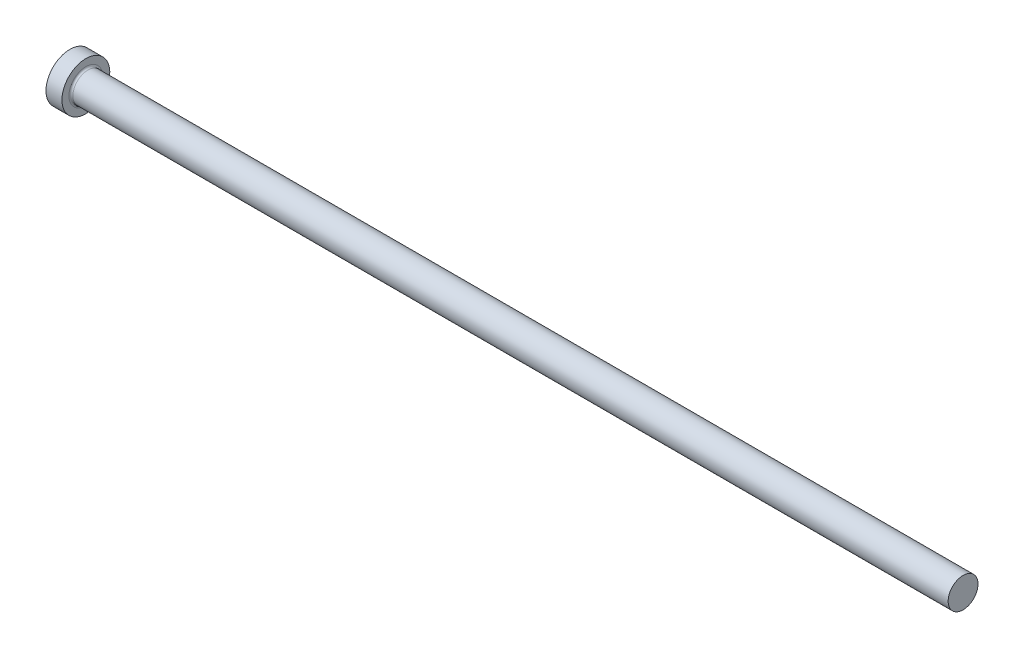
ISO-10303-21;
HEADER;
FILE_DESCRIPTION(('STEP AP214'),'2;1');
FILE_NAME('part.step','',(''),(''),'','','');
FILE_SCHEMA(('AUTOMOTIVE_DESIGN { 1 0 10303 214 1 1 1 1 }'));
ENDSEC;
DATA;
#1=APPLICATION_CONTEXT('core data for automotive mechanical design processes');
#2=APPLICATION_PROTOCOL_DEFINITION('international standard','automotive_design',2000,#1);
#3=PRODUCT_CONTEXT('',#1,'mechanical');
#4=PRODUCT('Part','Part','',(#3));
#5=PRODUCT_RELATED_PRODUCT_CATEGORY('part','',(#4));
#6=PRODUCT_DEFINITION_FORMATION('','',#4);
#7=PRODUCT_DEFINITION_CONTEXT('part definition',#1,'design');
#8=PRODUCT_DEFINITION('design','',#6,#7);
#9=PRODUCT_DEFINITION_SHAPE('','',#8);
#10=(LENGTH_UNIT() NAMED_UNIT(*) SI_UNIT(.MILLI.,.METRE.));
#11=(NAMED_UNIT(*) PLANE_ANGLE_UNIT() SI_UNIT($,.RADIAN.));
#12=(NAMED_UNIT(*) SI_UNIT($,.STERADIAN.) SOLID_ANGLE_UNIT());
#13=UNCERTAINTY_MEASURE_WITH_UNIT(LENGTH_MEASURE(1.E-05),#10,'distance_accuracy_value','');
#14=(GEOMETRIC_REPRESENTATION_CONTEXT(3) GLOBAL_UNCERTAINTY_ASSIGNED_CONTEXT((#13)) GLOBAL_UNIT_ASSIGNED_CONTEXT((#10,
#11,#12)) REPRESENTATION_CONTEXT('',''));
#15=CARTESIAN_POINT('',(0.,0.,0.));
#16=DIRECTION('',(0.,0.,1.));
#17=DIRECTION('',(1.,0.,0.));
#18=AXIS2_PLACEMENT_3D('',#15,#16,#17);
#19=CARTESIAN_POINT('',(0.,0.,0.));
#20=DIRECTION('',(1.,0.,0.));
#21=DIRECTION('',(0.,1.,0.));
#22=AXIS2_PLACEMENT_3D('',#19,#20,#21);
#23=PLANE('',#22);
#24=CARTESIAN_POINT('',(0.,0.,0.));
#25=DIRECTION('',(-1.,0.,0.));
#26=DIRECTION('',(0.,-1.,0.));
#27=AXIS2_PLACEMENT_3D('',#24,#25,#26);
#28=CIRCLE('',#27,9.52499999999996);
#29=CARTESIAN_POINT('',(0.,-9.52499999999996,0.));
#30=VERTEX_POINT('',#29);
#31=EDGE_CURVE('E10',#30,#30,#28,.T.);
#32=ORIENTED_EDGE('',*,*,#31,.T.);
#33=EDGE_LOOP('',(#32));
#34=FACE_BOUND('',#33,.T.);
#35=ADVANCED_FACE('F29',(#34),#23,.F.);
#36=CARTESIAN_POINT('',(355.6,0.,0.));
#37=DIRECTION('',(-1.,0.,0.));
#38=DIRECTION('',(0.,-1.,0.));
#39=AXIS2_PLACEMENT_3D('',#36,#37,#38);
#40=CYLINDRICAL_SURFACE('',#39,9.52499999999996);
#41=ORIENTED_EDGE('',*,*,#31,.F.);
#42=EDGE_LOOP('',(#41));
#43=FACE_BOUND('',#42,.T.);
#44=CARTESIAN_POINT('',(6.35000000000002,0.,0.));
#45=DIRECTION('',(-1.,0.,0.));
#46=DIRECTION('',(0.,-1.,0.));
#47=AXIS2_PLACEMENT_3D('',#44,#45,#46);
#48=CIRCLE('',#47,9.52499999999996);
#49=CARTESIAN_POINT('',(6.35000000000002,-9.52499999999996,0.));
#50=VERTEX_POINT('',#49);
#51=EDGE_CURVE('E35',#50,#50,#48,.T.);
#52=ORIENTED_EDGE('',*,*,#51,.T.);
#53=EDGE_LOOP('',(#52));
#54=FACE_BOUND('',#53,.T.);
#55=ADVANCED_FACE('F64',(#43,#54),#40,.T.);
#56=CARTESIAN_POINT('',(6.35,9.52499999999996,0.));
#57=DIRECTION('',(-1.,0.,0.));
#58=DIRECTION('',(0.,-1.,0.));
#59=AXIS2_PLACEMENT_3D('',#56,#57,#58);
#60=PLANE('',#59);
#61=ORIENTED_EDGE('',*,*,#51,.F.);
#62=EDGE_LOOP('',(#61));
#63=FACE_BOUND('',#62,.T.);
#64=CARTESIAN_POINT('',(6.35000000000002,0.,0.));
#65=DIRECTION('',(-1.,0.,0.));
#66=DIRECTION('',(0.,-1.,0.));
#67=AXIS2_PLACEMENT_3D('',#64,#65,#66);
#68=CIRCLE('',#67,6.73481);
#69=CARTESIAN_POINT('',(6.35000000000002,-6.73481,0.));
#70=VERTEX_POINT('',#69);
#71=EDGE_CURVE('E39',#70,#70,#68,.T.);
#72=ORIENTED_EDGE('',*,*,#71,.T.);
#73=EDGE_LOOP('',(#72));
#74=FACE_BOUND('',#73,.T.);
#75=ADVANCED_FACE('F68',(#63,#74),#60,.F.);
#76=CARTESIAN_POINT('',(7.1374,0.,0.));
#77=DIRECTION('',(-1.,0.,0.));
#78=DIRECTION('',(0.,-1.,0.));
#79=AXIS2_PLACEMENT_3D('',#76,#77,#78);
#80=TOROIDAL_SURFACE('',#79,6.73481,0.7874);
#81=ORIENTED_EDGE('',*,*,#71,.F.);
#82=EDGE_LOOP('',(#81));
#83=FACE_BOUND('',#82,.T.);
#84=CARTESIAN_POINT('',(7.13740000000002,0.,0.));
#85=DIRECTION('',(-1.,0.,0.));
#86=DIRECTION('',(0.,-1.,0.));
#87=AXIS2_PLACEMENT_3D('',#84,#85,#86);
#88=CIRCLE('',#87,5.94741);
#89=CARTESIAN_POINT('',(7.13740000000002,-5.94741,0.));
#90=VERTEX_POINT('',#89);
#91=EDGE_CURVE('E43',#90,#90,#88,.T.);
#92=ORIENTED_EDGE('',*,*,#91,.T.);
#93=EDGE_LOOP('',(#92));
#94=FACE_BOUND('',#93,.T.);
#95=ADVANCED_FACE('F60',(#83,#94),#80,.F.);
#96=CARTESIAN_POINT('',(355.6,0.,0.));
#97=DIRECTION('',(-1.,0.,0.));
#98=DIRECTION('',(0.,-1.,0.));
#99=AXIS2_PLACEMENT_3D('',#96,#97,#98);
#100=CYLINDRICAL_SURFACE('',#99,5.94740999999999);
#101=ORIENTED_EDGE('',*,*,#91,.F.);
#102=EDGE_LOOP('',(#101));
#103=FACE_BOUND('',#102,.T.);
#104=CARTESIAN_POINT('',(355.6,0.,0.));
#105=DIRECTION('',(-1.,0.,0.));
#106=DIRECTION('',(0.,-1.,0.));
#107=AXIS2_PLACEMENT_3D('',#104,#105,#106);
#108=CIRCLE('',#107,5.94740999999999);
#109=CARTESIAN_POINT('',(355.6,-5.94740999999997,0.));
#110=VERTEX_POINT('',#109);
#111=EDGE_CURVE('E48',#110,#110,#108,.T.);
#112=ORIENTED_EDGE('',*,*,#111,.T.);
#113=EDGE_LOOP('',(#112));
#114=FACE_BOUND('',#113,.T.);
#115=ADVANCED_FACE('F52',(#103,#114),#100,.T.);
#116=CARTESIAN_POINT('',(355.6,5.94741,0.));
#117=DIRECTION('',(-1.,0.,0.));
#118=DIRECTION('',(0.,-1.,0.));
#119=AXIS2_PLACEMENT_3D('',#116,#117,#118);
#120=PLANE('',#119);
#121=ORIENTED_EDGE('',*,*,#111,.F.);
#122=EDGE_LOOP('',(#121));
#123=FACE_BOUND('',#122,.T.);
#124=ADVANCED_FACE('F54',(#123),#120,.F.);
#125=CLOSED_SHELL('',(#35,#55,#75,#95,#115,#124));
#126=MANIFOLD_SOLID_BREP('B2',#125);
#127=ADVANCED_BREP_SHAPE_REPRESENTATION('',(#18,#126),#14);
#128=SHAPE_DEFINITION_REPRESENTATION(#9,#127);
ENDSEC;
END-ISO-10303-21;
